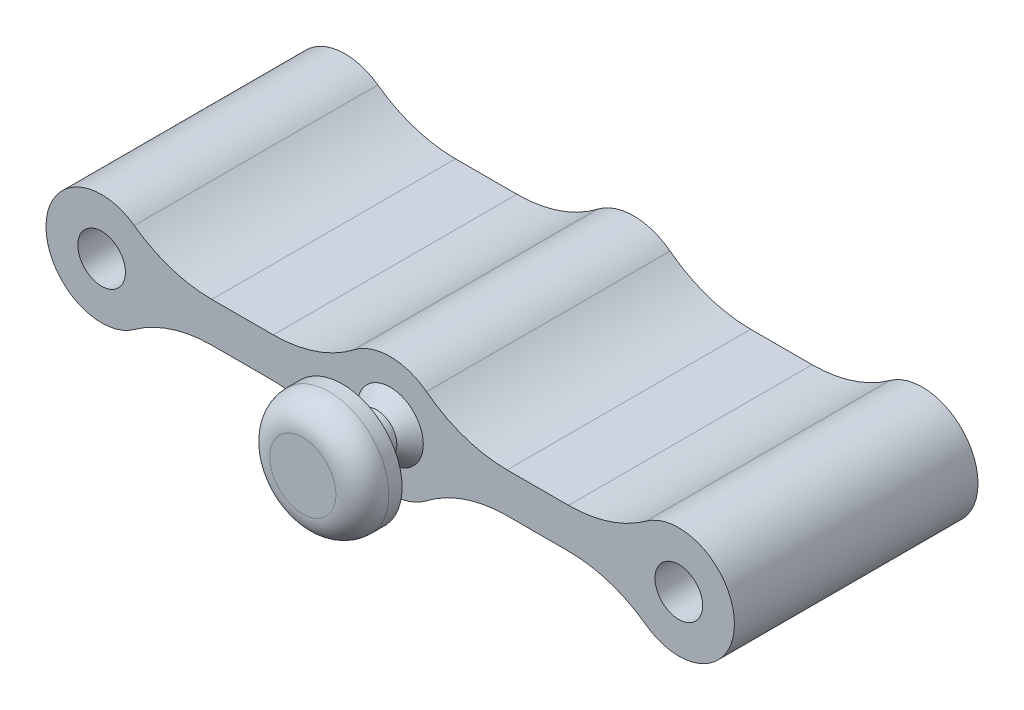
ISO-10303-21;
HEADER;
FILE_DESCRIPTION(('STEP AP214'),'2;1');
FILE_NAME('part.step','',(''),(''),'','','');
FILE_SCHEMA(('AUTOMOTIVE_DESIGN { 1 0 10303 214 1 1 1 1 }'));
ENDSEC;
DATA;
#1=APPLICATION_CONTEXT('core data for automotive mechanical design processes');
#2=APPLICATION_PROTOCOL_DEFINITION('international standard','automotive_design',2000,#1);
#3=PRODUCT_CONTEXT('',#1,'mechanical');
#4=PRODUCT('Part','Part','',(#3));
#5=PRODUCT_RELATED_PRODUCT_CATEGORY('part','',(#4));
#6=PRODUCT_DEFINITION_FORMATION('','',#4);
#7=PRODUCT_DEFINITION_CONTEXT('part definition',#1,'design');
#8=PRODUCT_DEFINITION('design','',#6,#7);
#9=PRODUCT_DEFINITION_SHAPE('','',#8);
#10=(LENGTH_UNIT() NAMED_UNIT(*) SI_UNIT(.MILLI.,.METRE.));
#11=(NAMED_UNIT(*) PLANE_ANGLE_UNIT() SI_UNIT($,.RADIAN.));
#12=(NAMED_UNIT(*) SI_UNIT($,.STERADIAN.) SOLID_ANGLE_UNIT());
#13=UNCERTAINTY_MEASURE_WITH_UNIT(LENGTH_MEASURE(1.E-05),#10,'distance_accuracy_value','');
#14=(GEOMETRIC_REPRESENTATION_CONTEXT(3) GLOBAL_UNCERTAINTY_ASSIGNED_CONTEXT((#13)) GLOBAL_UNIT_ASSIGNED_CONTEXT((#10,
#11,#12)) REPRESENTATION_CONTEXT('',''));
#15=CARTESIAN_POINT('',(0.,0.,0.));
#16=DIRECTION('',(0.,0.,1.));
#17=DIRECTION('',(1.,0.,0.));
#18=AXIS2_PLACEMENT_3D('',#15,#16,#17);
#19=CARTESIAN_POINT('',(-1.16884664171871E-05,-23.4999999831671,18.7));
#20=DIRECTION('',(0.,0.,1.));
#21=DIRECTION('',(1.,0.,0.));
#22=AXIS2_PLACEMENT_3D('',#19,#20,#21);
#23=PLANE('',#22);
#24=CARTESIAN_POINT('',(21.7999883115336,-23.4999999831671,18.7));
#25=DIRECTION('',(0.,0.,1.));
#26=DIRECTION('',(1.,0.,0.));
#27=AXIS2_PLACEMENT_3D('',#24,#25,#26);
#28=CIRCLE('',#27,2.5);
#29=CARTESIAN_POINT('',(24.2999883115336,-23.4999999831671,18.7));
#30=VERTEX_POINT('',#29);
#31=EDGE_CURVE('E13',#30,#30,#28,.F.);
#32=ORIENTED_EDGE('',*,*,#31,.T.);
#33=EDGE_LOOP('',(#32));
#34=FACE_BOUND('',#33,.T.);
#35=CARTESIAN_POINT('',(-1.16884664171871E-05,-23.4999999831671,18.7));
#36=DIRECTION('',(0.,0.,1.));
#37=DIRECTION('',(1.,0.,0.));
#38=AXIS2_PLACEMENT_3D('',#35,#36,#37);
#39=CIRCLE('',#38,1.8);
#40=CARTESIAN_POINT('',(1.79998831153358,-23.4999999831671,18.7));
#41=VERTEX_POINT('',#40);
#42=EDGE_CURVE('E261',#41,#41,#39,.T.);
#43=ORIENTED_EDGE('',*,*,#42,.F.);
#44=EDGE_LOOP('',(#43));
#45=FACE_BOUND('',#44,.T.);
#46=CARTESIAN_POINT('',(43.5999883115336,-23.4999999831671,18.7));
#47=DIRECTION('',(0.,0.,-1.));
#48=DIRECTION('',(-1.,0.,0.));
#49=AXIS2_PLACEMENT_3D('',#46,#47,#48);
#50=CIRCLE('',#49,1.8);
#51=CARTESIAN_POINT('',(41.7999883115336,-23.4999999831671,18.7));
#52=VERTEX_POINT('',#51);
#53=EDGE_CURVE('E239',#52,#52,#50,.T.);
#54=ORIENTED_EDGE('',*,*,#53,.T.);
#55=EDGE_LOOP('',(#54));
#56=FACE_BOUND('',#55,.T.);
#57=DIRECTION('',(1.,0.,0.));
#58=VECTOR('',#57,1.);
#59=CARTESIAN_POINT('',(1.79998831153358,-21.9999999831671,18.7));
#60=LINE('',#59,#58);
#61=CARTESIAN_POINT('',(30.6317491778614,-21.9999999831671,18.7));
#62=VERTEX_POINT('',#61);
#63=CARTESIAN_POINT('',(35.2699222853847,-21.9999999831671,18.7));
#64=VERTEX_POINT('',#63);
#65=EDGE_CURVE('E251',#62,#64,#60,.T.);
#66=ORIENTED_EDGE('',*,*,#65,.F.);
#67=CARTESIAN_POINT('',(30.6317491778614,-11.9999999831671,18.7));
#68=DIRECTION('',(0.,0.,1.));
#69=DIRECTION('',(1.,0.,0.));
#70=AXIS2_PLACEMENT_3D('',#67,#68,#69);
#71=CIRCLE('',#70,10.);
#72=CARTESIAN_POINT('',(24.5408796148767,-19.9310344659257,18.7));
#73=VERTEX_POINT('',#72);
#74=EDGE_CURVE('E320',#62,#73,#71,.F.);
#75=ORIENTED_EDGE('',*,*,#74,.T.);
#76=CARTESIAN_POINT('',(21.7999883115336,-23.4999999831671,18.7));
#77=DIRECTION('',(0.,0.,1.));
#78=DIRECTION('',(1.,0.,0.));
#79=AXIS2_PLACEMENT_3D('',#76,#77,#78);
#80=CIRCLE('',#79,4.5);
#81=CARTESIAN_POINT('',(19.0590970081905,-19.9310344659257,18.7));
#82=VERTEX_POINT('',#81);
#83=EDGE_CURVE('E232',#73,#82,#80,.T.);
#84=ORIENTED_EDGE('',*,*,#83,.T.);
#85=CARTESIAN_POINT('',(12.9682274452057,-11.9999999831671,18.7));
#86=DIRECTION('',(0.,0.,1.));
#87=DIRECTION('',(1.,0.,0.));
#88=AXIS2_PLACEMENT_3D('',#85,#86,#87);
#89=CIRCLE('',#88,10.);
#90=CARTESIAN_POINT('',(12.9682274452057,-21.9999999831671,18.7));
#91=VERTEX_POINT('',#90);
#92=EDGE_CURVE('E318',#82,#91,#89,.F.);
#93=ORIENTED_EDGE('',*,*,#92,.T.);
#94=CARTESIAN_POINT('',(8.33005433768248,-21.9999999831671,18.7));
#95=VERTEX_POINT('',#94);
#96=EDGE_CURVE('E253',#95,#91,#60,.T.);
#97=ORIENTED_EDGE('',*,*,#96,.F.);
#98=CARTESIAN_POINT('',(8.33005433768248,-11.9999999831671,18.7));
#99=DIRECTION('',(0.,0.,1.));
#100=DIRECTION('',(1.,0.,0.));
#101=AXIS2_PLACEMENT_3D('',#98,#99,#100);
#102=CIRCLE('',#101,10.);
#103=CARTESIAN_POINT('',(2.46381065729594,-20.0985915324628,18.7));
#104=VERTEX_POINT('',#103);
#105=EDGE_CURVE('E65',#95,#104,#102,.F.);
#106=ORIENTED_EDGE('',*,*,#105,.T.);
#107=CARTESIAN_POINT('',(-1.16884664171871E-05,-23.4999999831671,18.7));
#108=DIRECTION('',(0.,0.,1.));
#109=DIRECTION('',(1.,0.,0.));
#110=AXIS2_PLACEMENT_3D('',#107,#108,#109);
#111=CIRCLE('',#110,4.2);
#112=CARTESIAN_POINT('',(2.46381065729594,-26.9014084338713,18.7));
#113=VERTEX_POINT('',#112);
#114=EDGE_CURVE('E267',#104,#113,#111,.T.);
#115=ORIENTED_EDGE('',*,*,#114,.T.);
#116=CARTESIAN_POINT('',(8.33005433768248,-34.9999999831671,18.7));
#117=DIRECTION('',(0.,0.,1.));
#118=DIRECTION('',(1.,0.,0.));
#119=AXIS2_PLACEMENT_3D('',#116,#117,#118);
#120=CIRCLE('',#119,10.);
#121=CARTESIAN_POINT('',(8.33005433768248,-24.9999999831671,18.7));
#122=VERTEX_POINT('',#121);
#123=EDGE_CURVE('E57',#113,#122,#120,.F.);
#124=ORIENTED_EDGE('',*,*,#123,.T.);
#125=DIRECTION('',(1.,0.,0.));
#126=VECTOR('',#125,1.);
#127=CARTESIAN_POINT('',(1.79998831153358,-24.9999999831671,18.7));
#128=LINE('',#127,#126);
#129=CARTESIAN_POINT('',(12.9682274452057,-24.9999999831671,18.7));
#130=VERTEX_POINT('',#129);
#131=EDGE_CURVE('E258',#122,#130,#128,.T.);
#132=ORIENTED_EDGE('',*,*,#131,.T.);
#133=CARTESIAN_POINT('',(12.9682274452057,-34.9999999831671,18.7));
#134=DIRECTION('',(0.,0.,1.));
#135=DIRECTION('',(1.,0.,0.));
#136=AXIS2_PLACEMENT_3D('',#133,#134,#135);
#137=CIRCLE('',#136,10.);
#138=CARTESIAN_POINT('',(19.0590970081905,-27.0689655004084,18.7));
#139=VERTEX_POINT('',#138);
#140=EDGE_CURVE('E190',#130,#139,#137,.F.);
#141=ORIENTED_EDGE('',*,*,#140,.T.);
#142=CARTESIAN_POINT('',(24.5408796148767,-27.0689655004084,18.7));
#143=VERTEX_POINT('',#142);
#144=EDGE_CURVE('E229',#139,#143,#80,.T.);
#145=ORIENTED_EDGE('',*,*,#144,.T.);
#146=CARTESIAN_POINT('',(30.6317491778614,-34.9999999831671,18.7));
#147=DIRECTION('',(0.,0.,1.));
#148=DIRECTION('',(1.,0.,0.));
#149=AXIS2_PLACEMENT_3D('',#146,#147,#148);
#150=CIRCLE('',#149,10.);
#151=CARTESIAN_POINT('',(30.6317491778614,-24.9999999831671,18.7));
#152=VERTEX_POINT('',#151);
#153=EDGE_CURVE('E188',#143,#152,#150,.F.);
#154=ORIENTED_EDGE('',*,*,#153,.T.);
#155=CARTESIAN_POINT('',(35.2699222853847,-24.9999999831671,18.7));
#156=VERTEX_POINT('',#155);
#157=EDGE_CURVE('E165',#152,#156,#128,.T.);
#158=ORIENTED_EDGE('',*,*,#157,.T.);
#159=CARTESIAN_POINT('',(35.2699222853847,-34.9999999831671,18.7));
#160=DIRECTION('',(0.,0.,1.));
#161=DIRECTION('',(1.,0.,0.));
#162=AXIS2_PLACEMENT_3D('',#159,#160,#161);
#163=CIRCLE('',#162,10.);
#164=CARTESIAN_POINT('',(41.1361659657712,-26.9014084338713,18.7));
#165=VERTEX_POINT('',#164);
#166=EDGE_CURVE('E309',#156,#165,#163,.F.);
#167=ORIENTED_EDGE('',*,*,#166,.T.);
#168=CARTESIAN_POINT('',(43.5999883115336,-23.4999999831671,18.7));
#169=DIRECTION('',(0.,0.,-1.));
#170=DIRECTION('',(-1.,0.,0.));
#171=AXIS2_PLACEMENT_3D('',#168,#169,#170);
#172=CIRCLE('',#171,4.2);
#173=CARTESIAN_POINT('',(41.1361659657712,-20.0985915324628,18.7));
#174=VERTEX_POINT('',#173);
#175=EDGE_CURVE('E181',#174,#165,#172,.T.);
#176=ORIENTED_EDGE('',*,*,#175,.F.);
#177=CARTESIAN_POINT('',(35.2699222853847,-11.9999999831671,18.7));
#178=DIRECTION('',(0.,0.,1.));
#179=DIRECTION('',(1.,0.,0.));
#180=AXIS2_PLACEMENT_3D('',#177,#178,#179);
#181=CIRCLE('',#180,10.);
#182=EDGE_CURVE('E312',#174,#64,#181,.F.);
#183=ORIENTED_EDGE('',*,*,#182,.T.);
#184=EDGE_LOOP('',(#66,#75,#84,#93,#97,#106,#115,#124,#132,#141,#145,#154,#158,#167,#176,#183));
#185=FACE_BOUND('',#184,.T.);
#186=ADVANCED_FACE('F42',(#34,#45,#56,#185),#23,.T.);
#187=CARTESIAN_POINT('',(0.,-21.9999999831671,0.));
#188=DIRECTION('',(0.,-1.,0.));
#189=DIRECTION('',(0.,0.,-1.));
#190=AXIS2_PLACEMENT_3D('',#187,#188,#189);
#191=PLANE('',#190);
#192=ORIENTED_EDGE('',*,*,#65,.T.);
#193=DIRECTION('',(0.,0.,1.));
#194=VECTOR('',#193,1.);
#195=CARTESIAN_POINT('',(35.2699222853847,-21.9999999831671,0.300000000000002));
#196=LINE('',#195,#194);
#197=CARTESIAN_POINT('',(35.2699222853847,-21.9999999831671,0.300000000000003));
#198=VERTEX_POINT('',#197);
#199=EDGE_CURVE('E285',#64,#198,#196,.F.);
#200=ORIENTED_EDGE('',*,*,#199,.T.);
#201=DIRECTION('',(1.,0.,0.));
#202=VECTOR('',#201,1.);
#203=CARTESIAN_POINT('',(1.79998831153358,-21.9999999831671,0.3));
#204=LINE('',#203,#202);
#205=CARTESIAN_POINT('',(30.6317491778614,-21.9999999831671,0.300000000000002));
#206=VERTEX_POINT('',#205);
#207=EDGE_CURVE('E252',#206,#198,#204,.T.);
#208=ORIENTED_EDGE('',*,*,#207,.F.);
#209=DIRECTION('',(0.,0.,1.));
#210=VECTOR('',#209,1.);
#211=CARTESIAN_POINT('',(30.6317491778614,-21.9999999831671,0.));
#212=LINE('',#211,#210);
#213=EDGE_CURVE('E282',#206,#62,#212,.T.);
#214=ORIENTED_EDGE('',*,*,#213,.T.);
#215=EDGE_LOOP('',(#192,#200,#208,#214));
#216=FACE_BOUND('',#215,.T.);
#217=ADVANCED_FACE('F332',(#216),#191,.F.);
#218=CARTESIAN_POINT('',(0.,-24.9999999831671,0.));
#219=DIRECTION('',(0.,-1.,0.));
#220=DIRECTION('',(0.,0.,-1.));
#221=AXIS2_PLACEMENT_3D('',#218,#219,#220);
#222=PLANE('',#221);
#223=DIRECTION('',(1.,0.,0.));
#224=VECTOR('',#223,1.);
#225=CARTESIAN_POINT('',(1.79998831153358,-24.9999999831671,0.3));
#226=LINE('',#225,#224);
#227=CARTESIAN_POINT('',(30.6317491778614,-24.9999999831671,0.300000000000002));
#228=VERTEX_POINT('',#227);
#229=CARTESIAN_POINT('',(35.2699222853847,-24.9999999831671,0.300000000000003));
#230=VERTEX_POINT('',#229);
#231=EDGE_CURVE('E162',#228,#230,#226,.T.);
#232=ORIENTED_EDGE('',*,*,#231,.T.);
#233=DIRECTION('',(0.,0.,-1.));
#234=VECTOR('',#233,1.);
#235=CARTESIAN_POINT('',(35.2699222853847,-24.9999999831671,0.));
#236=LINE('',#235,#234);
#237=EDGE_CURVE('E168',#230,#156,#236,.F.);
#238=ORIENTED_EDGE('',*,*,#237,.T.);
#239=ORIENTED_EDGE('',*,*,#157,.F.);
#240=DIRECTION('',(0.,0.,-1.));
#241=VECTOR('',#240,1.);
#242=CARTESIAN_POINT('',(30.6317491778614,-24.9999999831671,0.3));
#243=LINE('',#242,#241);
#244=EDGE_CURVE('E158',#152,#228,#243,.T.);
#245=ORIENTED_EDGE('',*,*,#244,.T.);
#246=EDGE_LOOP('',(#232,#238,#239,#245));
#247=FACE_BOUND('',#246,.T.);
#248=ADVANCED_FACE('F160',(#247),#222,.T.);
#249=CARTESIAN_POINT('',(-1.16884664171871E-05,-23.4999999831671,18.7));
#250=DIRECTION('',(0.,0.,-1.));
#251=DIRECTION('',(-1.,0.,0.));
#252=AXIS2_PLACEMENT_3D('',#249,#250,#251);
#253=CYLINDRICAL_SURFACE('',#252,4.2);
#254=CARTESIAN_POINT('',(-1.16884664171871E-05,-23.4999999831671,0.3));
#255=DIRECTION('',(0.,0.,1.));
#256=DIRECTION('',(1.,0.,0.));
#257=AXIS2_PLACEMENT_3D('',#254,#255,#256);
#258=CIRCLE('',#257,4.2);
#259=CARTESIAN_POINT('',(2.46381065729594,-20.0985915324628,0.3));
#260=VERTEX_POINT('',#259);
#261=CARTESIAN_POINT('',(2.46381065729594,-26.9014084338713,0.3));
#262=VERTEX_POINT('',#261);
#263=EDGE_CURVE('E264',#260,#262,#258,.T.);
#264=ORIENTED_EDGE('',*,*,#263,.T.);
#265=DIRECTION('',(0.,0.,-1.));
#266=VECTOR('',#265,1.);
#267=CARTESIAN_POINT('',(2.46381065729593,-26.9014084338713,18.7));
#268=LINE('',#267,#266);
#269=EDGE_CURVE('E307',#262,#113,#268,.F.);
#270=ORIENTED_EDGE('',*,*,#269,.T.);
#271=ORIENTED_EDGE('',*,*,#114,.F.);
#272=DIRECTION('',(0.,0.,-1.));
#273=VECTOR('',#272,1.);
#274=CARTESIAN_POINT('',(2.46381065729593,-20.0985915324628,18.7));
#275=LINE('',#274,#273);
#276=EDGE_CURVE('E305',#104,#260,#275,.T.);
#277=ORIENTED_EDGE('',*,*,#276,.T.);
#278=EDGE_LOOP('',(#264,#270,#271,#277));
#279=FACE_BOUND('',#278,.T.);
#280=ADVANCED_FACE('F354',(#279),#253,.T.);
#281=CARTESIAN_POINT('',(-1.16884664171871E-05,-23.4999999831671,0.3));
#282=DIRECTION('',(0.,0.,1.));
#283=DIRECTION('',(1.,0.,0.));
#284=AXIS2_PLACEMENT_3D('',#281,#282,#283);
#285=PLANE('',#284);
#286=ORIENTED_EDGE('',*,*,#231,.F.);
#287=CARTESIAN_POINT('',(30.6317491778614,-34.9999999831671,0.3));
#288=DIRECTION('',(0.,0.,1.));
#289=DIRECTION('',(1.,0.,0.));
#290=AXIS2_PLACEMENT_3D('',#287,#288,#289);
#291=CIRCLE('',#290,10.);
#292=CARTESIAN_POINT('',(24.5408796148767,-27.0689655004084,0.3));
#293=VERTEX_POINT('',#292);
#294=EDGE_CURVE('E175',#228,#293,#291,.T.);
#295=ORIENTED_EDGE('',*,*,#294,.T.);
#296=CARTESIAN_POINT('',(21.7999883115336,-23.4999999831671,0.3));
#297=DIRECTION('',(0.,0.,1.));
#298=DIRECTION('',(1.,0.,0.));
#299=AXIS2_PLACEMENT_3D('',#296,#297,#298);
#300=CIRCLE('',#299,4.5);
#301=CARTESIAN_POINT('',(19.0590970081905,-27.0689655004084,0.3));
#302=VERTEX_POINT('',#301);
#303=EDGE_CURVE('E235',#293,#302,#300,.F.);
#304=ORIENTED_EDGE('',*,*,#303,.T.);
#305=CARTESIAN_POINT('',(12.9682274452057,-34.9999999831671,0.3));
#306=DIRECTION('',(0.,0.,1.));
#307=DIRECTION('',(1.,0.,0.));
#308=AXIS2_PLACEMENT_3D('',#305,#306,#307);
#309=CIRCLE('',#308,10.);
#310=CARTESIAN_POINT('',(12.9682274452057,-24.9999999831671,0.300000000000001));
#311=VERTEX_POINT('',#310);
#312=EDGE_CURVE('E187',#302,#311,#309,.T.);
#313=ORIENTED_EDGE('',*,*,#312,.T.);
#314=CARTESIAN_POINT('',(8.33005433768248,-24.9999999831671,0.3));
#315=VERTEX_POINT('',#314);
#316=EDGE_CURVE('E180',#315,#311,#226,.T.);
#317=ORIENTED_EDGE('',*,*,#316,.F.);
#318=CARTESIAN_POINT('',(8.33005433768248,-34.9999999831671,0.300000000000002));
#319=DIRECTION('',(0.,0.,1.));
#320=DIRECTION('',(1.,0.,0.));
#321=AXIS2_PLACEMENT_3D('',#318,#319,#320);
#322=CIRCLE('',#321,10.);
#323=EDGE_CURVE('E198',#315,#262,#322,.T.);
#324=ORIENTED_EDGE('',*,*,#323,.T.);
#325=ORIENTED_EDGE('',*,*,#263,.F.);
#326=CARTESIAN_POINT('',(8.33005433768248,-11.9999999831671,0.300000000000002));
#327=DIRECTION('',(0.,0.,1.));
#328=DIRECTION('',(1.,0.,0.));
#329=AXIS2_PLACEMENT_3D('',#326,#327,#328);
#330=CIRCLE('',#329,10.);
#331=CARTESIAN_POINT('',(8.33005433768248,-21.9999999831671,0.3));
#332=VERTEX_POINT('',#331);
#333=EDGE_CURVE('E201',#260,#332,#330,.T.);
#334=ORIENTED_EDGE('',*,*,#333,.T.);
#335=CARTESIAN_POINT('',(12.9682274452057,-21.9999999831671,0.300000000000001));
#336=VERTEX_POINT('',#335);
#337=EDGE_CURVE('E248',#332,#336,#204,.T.);
#338=ORIENTED_EDGE('',*,*,#337,.T.);
#339=CARTESIAN_POINT('',(12.9682274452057,-11.9999999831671,0.3));
#340=DIRECTION('',(0.,0.,1.));
#341=DIRECTION('',(1.,0.,0.));
#342=AXIS2_PLACEMENT_3D('',#339,#340,#341);
#343=CIRCLE('',#342,10.);
#344=CARTESIAN_POINT('',(19.0590970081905,-19.9310344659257,0.3));
#345=VERTEX_POINT('',#344);
#346=EDGE_CURVE('E316',#336,#345,#343,.T.);
#347=ORIENTED_EDGE('',*,*,#346,.T.);
#348=CARTESIAN_POINT('',(24.5408796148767,-19.9310344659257,0.3));
#349=VERTEX_POINT('',#348);
#350=EDGE_CURVE('E238',#345,#349,#300,.F.);
#351=ORIENTED_EDGE('',*,*,#350,.T.);
#352=CARTESIAN_POINT('',(30.6317491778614,-11.9999999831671,0.3));
#353=DIRECTION('',(0.,0.,1.));
#354=DIRECTION('',(1.,0.,0.));
#355=AXIS2_PLACEMENT_3D('',#352,#353,#354);
#356=CIRCLE('',#355,10.);
#357=EDGE_CURVE('E192',#349,#206,#356,.T.);
#358=ORIENTED_EDGE('',*,*,#357,.T.);
#359=ORIENTED_EDGE('',*,*,#207,.T.);
#360=CARTESIAN_POINT('',(35.2699222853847,-11.9999999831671,0.300000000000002));
#361=DIRECTION('',(0.,0.,1.));
#362=DIRECTION('',(1.,0.,0.));
#363=AXIS2_PLACEMENT_3D('',#360,#361,#362);
#364=CIRCLE('',#363,10.);
#365=CARTESIAN_POINT('',(41.1361659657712,-20.0985915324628,0.3));
#366=VERTEX_POINT('',#365);
#367=EDGE_CURVE('E314',#198,#366,#364,.T.);
#368=ORIENTED_EDGE('',*,*,#367,.T.);
#369=CARTESIAN_POINT('',(43.5999883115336,-23.4999999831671,0.3));
#370=DIRECTION('',(0.,0.,-1.));
#371=DIRECTION('',(-1.,0.,0.));
#372=AXIS2_PLACEMENT_3D('',#369,#370,#371);
#373=CIRCLE('',#372,4.2);
#374=CARTESIAN_POINT('',(41.1361659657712,-26.9014084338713,0.3));
#375=VERTEX_POINT('',#374);
#376=EDGE_CURVE('E242',#366,#375,#373,.T.);
#377=ORIENTED_EDGE('',*,*,#376,.T.);
#378=CARTESIAN_POINT('',(35.2699222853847,-34.9999999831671,0.300000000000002));
#379=DIRECTION('',(0.,0.,1.));
#380=DIRECTION('',(1.,0.,0.));
#381=AXIS2_PLACEMENT_3D('',#378,#379,#380);
#382=CIRCLE('',#381,10.);
#383=EDGE_CURVE('E179',#375,#230,#382,.T.);
#384=ORIENTED_EDGE('',*,*,#383,.T.);
#385=EDGE_LOOP('',(#286,#295,#304,#313,#317,#324,#325,#334,#338,#347,#351,#358,#359,#368,#377,#384));
#386=FACE_BOUND('',#385,.T.);
#387=CARTESIAN_POINT('',(43.5999883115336,-23.4999999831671,0.3));
#388=DIRECTION('',(0.,0.,-1.));
#389=DIRECTION('',(-1.,0.,0.));
#390=AXIS2_PLACEMENT_3D('',#387,#388,#389);
#391=CIRCLE('',#390,1.8);
#392=CARTESIAN_POINT('',(41.7999883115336,-23.4999999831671,0.3));
#393=VERTEX_POINT('',#392);
#394=EDGE_CURVE('E237',#393,#393,#391,.T.);
#395=ORIENTED_EDGE('',*,*,#394,.F.);
#396=EDGE_LOOP('',(#395));
#397=FACE_BOUND('',#396,.T.);
#398=CARTESIAN_POINT('',(-1.16884664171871E-05,-23.4999999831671,0.3));
#399=DIRECTION('',(0.,0.,1.));
#400=DIRECTION('',(1.,0.,0.));
#401=AXIS2_PLACEMENT_3D('',#398,#399,#400);
#402=CIRCLE('',#401,1.8);
#403=CARTESIAN_POINT('',(1.79998831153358,-23.4999999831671,0.3));
#404=VERTEX_POINT('',#403);
#405=EDGE_CURVE('E255',#404,#404,#402,.T.);
#406=ORIENTED_EDGE('',*,*,#405,.T.);
#407=EDGE_LOOP('',(#406));
#408=FACE_BOUND('',#407,.T.);
#409=ADVANCED_FACE('F172',(#386,#397,#408),#285,.F.);
#410=CARTESIAN_POINT('',(-1.16884664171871E-05,-23.4999999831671,18.7));
#411=DIRECTION('',(0.,0.,-1.));
#412=DIRECTION('',(-1.,0.,0.));
#413=AXIS2_PLACEMENT_3D('',#410,#411,#412);
#414=CYLINDRICAL_SURFACE('',#413,1.8);
#415=ORIENTED_EDGE('',*,*,#405,.F.);
#416=EDGE_LOOP('',(#415));
#417=FACE_BOUND('',#416,.T.);
#418=ORIENTED_EDGE('',*,*,#42,.T.);
#419=EDGE_LOOP('',(#418));
#420=FACE_BOUND('',#419,.T.);
#421=ADVANCED_FACE('F390',(#417,#420),#414,.F.);
#422=ORIENTED_EDGE('',*,*,#96,.T.);
#423=DIRECTION('',(0.,0.,1.));
#424=VECTOR('',#423,1.);
#425=CARTESIAN_POINT('',(12.9682274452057,-21.9999999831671,0.));
#426=LINE('',#425,#424);
#427=EDGE_CURVE('E290',#91,#336,#426,.F.);
#428=ORIENTED_EDGE('',*,*,#427,.T.);
#429=ORIENTED_EDGE('',*,*,#337,.F.);
#430=DIRECTION('',(0.,0.,1.));
#431=VECTOR('',#430,1.);
#432=CARTESIAN_POINT('',(8.33005433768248,-21.9999999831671,18.7));
#433=LINE('',#432,#431);
#434=EDGE_CURVE('E287',#332,#95,#433,.T.);
#435=ORIENTED_EDGE('',*,*,#434,.T.);
#436=EDGE_LOOP('',(#422,#428,#429,#435));
#437=FACE_BOUND('',#436,.T.);
#438=ADVANCED_FACE('F346',(#437),#191,.F.);
#439=ORIENTED_EDGE('',*,*,#316,.T.);
#440=DIRECTION('',(0.,0.,-1.));
#441=VECTOR('',#440,1.);
#442=CARTESIAN_POINT('',(12.9682274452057,-24.9999999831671,18.7));
#443=LINE('',#442,#441);
#444=EDGE_CURVE('E303',#311,#130,#443,.F.);
#445=ORIENTED_EDGE('',*,*,#444,.T.);
#446=ORIENTED_EDGE('',*,*,#131,.F.);
#447=DIRECTION('',(0.,0.,-1.));
#448=VECTOR('',#447,1.);
#449=CARTESIAN_POINT('',(8.33005433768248,-24.9999999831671,0.));
#450=LINE('',#449,#448);
#451=EDGE_CURVE('E301',#122,#315,#450,.T.);
#452=ORIENTED_EDGE('',*,*,#451,.T.);
#453=EDGE_LOOP('',(#439,#445,#446,#452));
#454=FACE_BOUND('',#453,.T.);
#455=ADVANCED_FACE('F361',(#454),#222,.T.);
#456=CARTESIAN_POINT('',(43.5999883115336,-23.4999999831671,18.7));
#457=DIRECTION('',(0.,0.,-1.));
#458=DIRECTION('',(1.,0.,0.));
#459=AXIS2_PLACEMENT_3D('',#456,#457,#458);
#460=CYLINDRICAL_SURFACE('',#459,4.2);
#461=ORIENTED_EDGE('',*,*,#175,.T.);
#462=DIRECTION('',(0.,0.,-1.));
#463=VECTOR('',#462,1.);
#464=CARTESIAN_POINT('',(41.1361659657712,-26.9014084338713,18.7));
#465=LINE('',#464,#463);
#466=EDGE_CURVE('E280',#165,#375,#465,.T.);
#467=ORIENTED_EDGE('',*,*,#466,.T.);
#468=ORIENTED_EDGE('',*,*,#376,.F.);
#469=DIRECTION('',(0.,0.,-1.));
#470=VECTOR('',#469,1.);
#471=CARTESIAN_POINT('',(41.1361659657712,-20.0985915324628,18.7));
#472=LINE('',#471,#470);
#473=EDGE_CURVE('E277',#366,#174,#472,.F.);
#474=ORIENTED_EDGE('',*,*,#473,.T.);
#475=EDGE_LOOP('',(#461,#467,#468,#474));
#476=FACE_BOUND('',#475,.T.);
#477=ADVANCED_FACE('F376',(#476),#460,.T.);
#478=CARTESIAN_POINT('',(43.5999883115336,-23.4999999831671,18.7));
#479=DIRECTION('',(0.,0.,-1.));
#480=DIRECTION('',(1.,0.,0.));
#481=AXIS2_PLACEMENT_3D('',#478,#479,#480);
#482=CYLINDRICAL_SURFACE('',#481,1.8);
#483=ORIENTED_EDGE('',*,*,#394,.T.);
#484=EDGE_LOOP('',(#483));
#485=FACE_BOUND('',#484,.T.);
#486=ORIENTED_EDGE('',*,*,#53,.F.);
#487=EDGE_LOOP('',(#486));
#488=FACE_BOUND('',#487,.T.);
#489=ADVANCED_FACE('F370',(#485,#488),#482,.F.);
#490=CARTESIAN_POINT('',(21.7999883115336,-23.4999999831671,-12.4279220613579));
#491=DIRECTION('',(0.,0.,1.));
#492=DIRECTION('',(1.,0.,0.));
#493=AXIS2_PLACEMENT_3D('',#490,#491,#492);
#494=CYLINDRICAL_SURFACE('',#493,4.5);
#495=ORIENTED_EDGE('',*,*,#303,.F.);
#496=DIRECTION('',(0.,0.,1.));
#497=VECTOR('',#496,1.);
#498=CARTESIAN_POINT('',(24.5408796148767,-27.0689655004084,-12.4279220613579));
#499=LINE('',#498,#497);
#500=EDGE_CURVE('E186',#293,#143,#499,.T.);
#501=ORIENTED_EDGE('',*,*,#500,.T.);
#502=ORIENTED_EDGE('',*,*,#144,.F.);
#503=DIRECTION('',(0.,0.,1.));
#504=VECTOR('',#503,1.);
#505=CARTESIAN_POINT('',(19.0590970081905,-27.0689655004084,-12.4279220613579));
#506=LINE('',#505,#504);
#507=EDGE_CURVE('E297',#139,#302,#506,.F.);
#508=ORIENTED_EDGE('',*,*,#507,.T.);
#509=EDGE_LOOP('',(#495,#501,#502,#508));
#510=FACE_BOUND('',#509,.T.);
#511=ADVANCED_FACE('F368',(#510),#494,.T.);
#512=ORIENTED_EDGE('',*,*,#350,.F.);
#513=DIRECTION('',(0.,0.,1.));
#514=VECTOR('',#513,1.);
#515=CARTESIAN_POINT('',(19.0590970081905,-19.9310344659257,-12.4279220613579));
#516=LINE('',#515,#514);
#517=EDGE_CURVE('E295',#345,#82,#516,.T.);
#518=ORIENTED_EDGE('',*,*,#517,.T.);
#519=ORIENTED_EDGE('',*,*,#83,.F.);
#520=DIRECTION('',(0.,0.,1.));
#521=VECTOR('',#520,1.);
#522=CARTESIAN_POINT('',(24.5408796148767,-19.9310344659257,-12.4279220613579));
#523=LINE('',#522,#521);
#524=EDGE_CURVE('E293',#73,#349,#523,.F.);
#525=ORIENTED_EDGE('',*,*,#524,.T.);
#526=EDGE_LOOP('',(#512,#518,#519,#525));
#527=FACE_BOUND('',#526,.T.);
#528=ADVANCED_FACE('F340',(#527),#494,.T.);
#529=CARTESIAN_POINT('',(21.7999883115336,-23.4999999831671,22.3));
#530=DIRECTION('',(0.,0.,-1.));
#531=DIRECTION('',(-1.,0.,0.));
#532=AXIS2_PLACEMENT_3D('',#529,#530,#531);
#533=CYLINDRICAL_SURFACE('',#532,1.5);
#534=CARTESIAN_POINT('',(21.7999883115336,-23.4999999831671,21.3));
#535=DIRECTION('',(0.,0.,1.));
#536=DIRECTION('',(1.,0.,0.));
#537=AXIS2_PLACEMENT_3D('',#534,#535,#536);
#538=CIRCLE('',#537,1.5);
#539=CARTESIAN_POINT('',(23.2999883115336,-23.4999999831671,21.3));
#540=VERTEX_POINT('',#539);
#541=EDGE_CURVE('E50',#540,#540,#538,.F.);
#542=ORIENTED_EDGE('',*,*,#541,.T.);
#543=EDGE_LOOP('',(#542));
#544=FACE_BOUND('',#543,.T.);
#545=CARTESIAN_POINT('',(21.7999883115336,-23.4999999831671,19.7));
#546=DIRECTION('',(0.,0.,1.));
#547=DIRECTION('',(1.,0.,0.));
#548=AXIS2_PLACEMENT_3D('',#545,#546,#547);
#549=CIRCLE('',#548,1.5);
#550=CARTESIAN_POINT('',(23.2999883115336,-23.4999999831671,19.7));
#551=VERTEX_POINT('',#550);
#552=EDGE_CURVE('E206',#551,#551,#549,.T.);
#553=ORIENTED_EDGE('',*,*,#552,.T.);
#554=EDGE_LOOP('',(#553));
#555=FACE_BOUND('',#554,.T.);
#556=ADVANCED_FACE('F211',(#544,#555),#533,.T.);
#557=CARTESIAN_POINT('',(21.7999883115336,-23.4999999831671,22.3));
#558=DIRECTION('',(0.,0.,1.));
#559=DIRECTION('',(1.,0.,0.));
#560=AXIS2_PLACEMENT_3D('',#557,#558,#559);
#561=PLANE('',#560);
#562=CARTESIAN_POINT('',(21.7999883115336,-23.4999999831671,22.3));
#563=DIRECTION('',(0.,0.,1.));
#564=DIRECTION('',(1.,0.,0.));
#565=AXIS2_PLACEMENT_3D('',#562,#563,#564);
#566=CIRCLE('',#565,2.50000000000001);
#567=CARTESIAN_POINT('',(24.2999883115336,-23.4999999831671,22.3));
#568=VERTEX_POINT('',#567);
#569=EDGE_CURVE('E203',#568,#568,#566,.T.);
#570=ORIENTED_EDGE('',*,*,#569,.T.);
#571=EDGE_LOOP('',(#570));
#572=FACE_BOUND('',#571,.T.);
#573=CARTESIAN_POINT('',(21.7999883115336,-23.4999999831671,22.3));
#574=DIRECTION('',(0.,0.,1.));
#575=DIRECTION('',(1.,0.,0.));
#576=AXIS2_PLACEMENT_3D('',#573,#574,#575);
#577=CIRCLE('',#576,4.5);
#578=CARTESIAN_POINT('',(26.2999883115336,-23.4999999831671,22.3));
#579=VERTEX_POINT('',#578);
#580=EDGE_CURVE('E227',#579,#579,#577,.T.);
#581=ORIENTED_EDGE('',*,*,#580,.F.);
#582=EDGE_LOOP('',(#581));
#583=FACE_BOUND('',#582,.T.);
#584=ADVANCED_FACE('F220',(#572,#583),#561,.F.);
#585=CARTESIAN_POINT('',(21.7999883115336,-23.4999999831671,25.3));
#586=DIRECTION('',(0.,0.,-1.));
#587=DIRECTION('',(-1.,0.,0.));
#588=AXIS2_PLACEMENT_3D('',#585,#586,#587);
#589=CYLINDRICAL_SURFACE('',#588,4.5);
#590=CARTESIAN_POINT('',(21.7999883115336,-23.4999999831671,23.3));
#591=DIRECTION('',(0.,0.,1.));
#592=DIRECTION('',(1.,0.,0.));
#593=AXIS2_PLACEMENT_3D('',#590,#591,#592);
#594=CIRCLE('',#593,4.5);
#595=CARTESIAN_POINT('',(26.2999883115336,-23.4999999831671,23.3));
#596=VERTEX_POINT('',#595);
#597=EDGE_CURVE('E169',#596,#596,#594,.F.);
#598=ORIENTED_EDGE('',*,*,#597,.T.);
#599=EDGE_LOOP('',(#598));
#600=FACE_BOUND('',#599,.T.);
#601=ORIENTED_EDGE('',*,*,#580,.T.);
#602=EDGE_LOOP('',(#601));
#603=FACE_BOUND('',#602,.T.);
#604=ADVANCED_FACE('F223',(#600,#603),#589,.T.);
#605=CARTESIAN_POINT('',(21.7999883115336,-23.4999999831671,25.3));
#606=DIRECTION('',(0.,0.,1.));
#607=DIRECTION('',(1.,0.,0.));
#608=AXIS2_PLACEMENT_3D('',#605,#606,#607);
#609=PLANE('',#608);
#610=CARTESIAN_POINT('',(21.7999883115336,-23.4999999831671,25.3));
#611=DIRECTION('',(0.,0.,1.));
#612=DIRECTION('',(1.,0.,0.));
#613=AXIS2_PLACEMENT_3D('',#610,#611,#612);
#614=CIRCLE('',#613,2.5);
#615=CARTESIAN_POINT('',(24.2999883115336,-23.4999999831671,25.3));
#616=VERTEX_POINT('',#615);
#617=EDGE_CURVE('E269',#616,#616,#614,.T.);
#618=ORIENTED_EDGE('',*,*,#617,.T.);
#619=EDGE_LOOP('',(#618));
#620=FACE_BOUND('',#619,.T.);
#621=ADVANCED_FACE('F400',(#620),#609,.T.);
#622=CARTESIAN_POINT('',(21.7999883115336,-23.4999999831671,23.3));
#623=DIRECTION('',(0.,0.,1.));
#624=DIRECTION('',(1.,0.,0.));
#625=AXIS2_PLACEMENT_3D('',#622,#623,#624);
#626=TOROIDAL_SURFACE('',#625,2.5,2.);
#627=ORIENTED_EDGE('',*,*,#597,.F.);
#628=EDGE_LOOP('',(#627));
#629=FACE_BOUND('',#628,.T.);
#630=ORIENTED_EDGE('',*,*,#617,.F.);
#631=EDGE_LOOP('',(#630));
#632=FACE_BOUND('',#631,.T.);
#633=ADVANCED_FACE('F396',(#629,#632),#626,.T.);
#634=CARTESIAN_POINT('',(35.2699222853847,-34.9999999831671,18.7));
#635=DIRECTION('',(0.,0.,-1.));
#636=DIRECTION('',(-1.,0.,0.));
#637=AXIS2_PLACEMENT_3D('',#634,#635,#636);
#638=CYLINDRICAL_SURFACE('',#637,10.);
#639=ORIENTED_EDGE('',*,*,#383,.F.);
#640=ORIENTED_EDGE('',*,*,#466,.F.);
#641=ORIENTED_EDGE('',*,*,#166,.F.);
#642=ORIENTED_EDGE('',*,*,#237,.F.);
#643=EDGE_LOOP('',(#639,#640,#641,#642));
#644=FACE_BOUND('',#643,.T.);
#645=ADVANCED_FACE('F399',(#644),#638,.F.);
#646=CARTESIAN_POINT('',(35.2699222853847,-11.9999999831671,18.7));
#647=DIRECTION('',(0.,0.,-1.));
#648=DIRECTION('',(-1.,0.,0.));
#649=AXIS2_PLACEMENT_3D('',#646,#647,#648);
#650=CYLINDRICAL_SURFACE('',#649,10.);
#651=ORIENTED_EDGE('',*,*,#367,.F.);
#652=ORIENTED_EDGE('',*,*,#199,.F.);
#653=ORIENTED_EDGE('',*,*,#182,.F.);
#654=ORIENTED_EDGE('',*,*,#473,.F.);
#655=EDGE_LOOP('',(#651,#652,#653,#654));
#656=FACE_BOUND('',#655,.T.);
#657=ADVANCED_FACE('F404',(#656),#650,.F.);
#658=CARTESIAN_POINT('',(12.9682274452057,-11.9999999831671,-12.4279220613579));
#659=DIRECTION('',(0.,0.,1.));
#660=DIRECTION('',(1.,0.,0.));
#661=AXIS2_PLACEMENT_3D('',#658,#659,#660);
#662=CYLINDRICAL_SURFACE('',#661,10.);
#663=ORIENTED_EDGE('',*,*,#92,.F.);
#664=ORIENTED_EDGE('',*,*,#517,.F.);
#665=ORIENTED_EDGE('',*,*,#346,.F.);
#666=ORIENTED_EDGE('',*,*,#427,.F.);
#667=EDGE_LOOP('',(#663,#664,#665,#666));
#668=FACE_BOUND('',#667,.T.);
#669=ADVANCED_FACE('F343',(#668),#662,.F.);
#670=CARTESIAN_POINT('',(30.6317491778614,-11.9999999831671,-12.4279220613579));
#671=DIRECTION('',(0.,0.,1.));
#672=DIRECTION('',(1.,0.,0.));
#673=AXIS2_PLACEMENT_3D('',#670,#671,#672);
#674=CYLINDRICAL_SURFACE('',#673,10.);
#675=ORIENTED_EDGE('',*,*,#357,.F.);
#676=ORIENTED_EDGE('',*,*,#524,.F.);
#677=ORIENTED_EDGE('',*,*,#74,.F.);
#678=ORIENTED_EDGE('',*,*,#213,.F.);
#679=EDGE_LOOP('',(#675,#676,#677,#678));
#680=FACE_BOUND('',#679,.T.);
#681=ADVANCED_FACE('F335',(#680),#674,.F.);
#682=CARTESIAN_POINT('',(30.6317491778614,-34.9999999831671,-12.4279220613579));
#683=DIRECTION('',(0.,0.,1.));
#684=DIRECTION('',(1.,0.,0.));
#685=AXIS2_PLACEMENT_3D('',#682,#683,#684);
#686=CYLINDRICAL_SURFACE('',#685,10.);
#687=ORIENTED_EDGE('',*,*,#294,.F.);
#688=ORIENTED_EDGE('',*,*,#244,.F.);
#689=ORIENTED_EDGE('',*,*,#153,.F.);
#690=ORIENTED_EDGE('',*,*,#500,.F.);
#691=EDGE_LOOP('',(#687,#688,#689,#690));
#692=FACE_BOUND('',#691,.T.);
#693=ADVANCED_FACE('F184',(#692),#686,.F.);
#694=CARTESIAN_POINT('',(12.9682274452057,-34.9999999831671,-12.4279220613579));
#695=DIRECTION('',(0.,0.,1.));
#696=DIRECTION('',(1.,0.,0.));
#697=AXIS2_PLACEMENT_3D('',#694,#695,#696);
#698=CYLINDRICAL_SURFACE('',#697,10.);
#699=ORIENTED_EDGE('',*,*,#140,.F.);
#700=ORIENTED_EDGE('',*,*,#444,.F.);
#701=ORIENTED_EDGE('',*,*,#312,.F.);
#702=ORIENTED_EDGE('',*,*,#507,.F.);
#703=EDGE_LOOP('',(#699,#700,#701,#702));
#704=FACE_BOUND('',#703,.T.);
#705=ADVANCED_FACE('F364',(#704),#698,.F.);
#706=CARTESIAN_POINT('',(8.33005433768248,-34.9999999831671,18.7));
#707=DIRECTION('',(0.,0.,-1.));
#708=DIRECTION('',(-1.,0.,0.));
#709=AXIS2_PLACEMENT_3D('',#706,#707,#708);
#710=CYLINDRICAL_SURFACE('',#709,10.);
#711=ORIENTED_EDGE('',*,*,#323,.F.);
#712=ORIENTED_EDGE('',*,*,#451,.F.);
#713=ORIENTED_EDGE('',*,*,#123,.F.);
#714=ORIENTED_EDGE('',*,*,#269,.F.);
#715=EDGE_LOOP('',(#711,#712,#713,#714));
#716=FACE_BOUND('',#715,.T.);
#717=ADVANCED_FACE('F357',(#716),#710,.F.);
#718=CARTESIAN_POINT('',(8.33005433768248,-11.9999999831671,18.7));
#719=DIRECTION('',(0.,0.,-1.));
#720=DIRECTION('',(-1.,0.,0.));
#721=AXIS2_PLACEMENT_3D('',#718,#719,#720);
#722=CYLINDRICAL_SURFACE('',#721,10.);
#723=ORIENTED_EDGE('',*,*,#333,.F.);
#724=ORIENTED_EDGE('',*,*,#276,.F.);
#725=ORIENTED_EDGE('',*,*,#105,.F.);
#726=ORIENTED_EDGE('',*,*,#434,.F.);
#727=EDGE_LOOP('',(#723,#724,#725,#726));
#728=FACE_BOUND('',#727,.T.);
#729=ADVANCED_FACE('F217',(#728),#722,.F.);
#730=CARTESIAN_POINT('',(21.7999883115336,-23.4999999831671,22.3));
#731=DIRECTION('',(0.,0.,1.));
#732=DIRECTION('',(1.,0.,0.));
#733=AXIS2_PLACEMENT_3D('',#730,#731,#732);
#734=CONICAL_SURFACE('',#733,2.50000000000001,0.785398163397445);
#735=ORIENTED_EDGE('',*,*,#541,.F.);
#736=EDGE_LOOP('',(#735));
#737=FACE_BOUND('',#736,.T.);
#738=ORIENTED_EDGE('',*,*,#569,.F.);
#739=EDGE_LOOP('',(#738));
#740=FACE_BOUND('',#739,.T.);
#741=ADVANCED_FACE('F214',(#737,#740),#734,.T.);
#742=CARTESIAN_POINT('',(21.7999883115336,-23.4999999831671,19.7));
#743=DIRECTION('',(0.,0.,-1.));
#744=DIRECTION('',(-1.,0.,0.));
#745=AXIS2_PLACEMENT_3D('',#742,#743,#744);
#746=CONICAL_SURFACE('',#745,1.5,0.78539816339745);
#747=ORIENTED_EDGE('',*,*,#31,.F.);
#748=EDGE_LOOP('',(#747));
#749=FACE_BOUND('',#748,.T.);
#750=ORIENTED_EDGE('',*,*,#552,.F.);
#751=EDGE_LOOP('',(#750));
#752=FACE_BOUND('',#751,.T.);
#753=ADVANCED_FACE('F44',(#749,#752),#746,.T.);
#754=CLOSED_SHELL('',(#186,#217,#248,#280,#409,#421,#438,#455,#477,#489,#511,#528,#556,#584,
#604,#621,#633,#645,#657,#669,#681,#693,#705,#717,#729,#741,#753));
#755=MANIFOLD_SOLID_BREP('B2',#754);
#756=ADVANCED_BREP_SHAPE_REPRESENTATION('',(#18,#755),#14);
#757=SHAPE_DEFINITION_REPRESENTATION(#9,#756);
ENDSEC;
END-ISO-10303-21;
